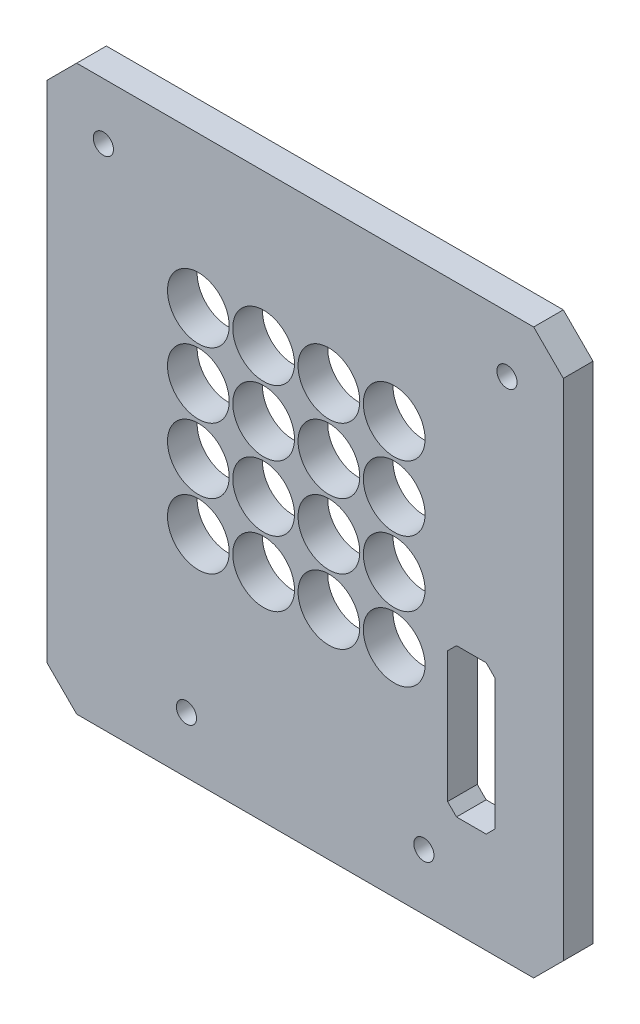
ISO-10303-21;
HEADER;
FILE_DESCRIPTION(('STEP AP214'),'2;1');
FILE_NAME('part.step','',(''),(''),'','','');
FILE_SCHEMA(('AUTOMOTIVE_DESIGN { 1 0 10303 214 1 1 1 1 }'));
ENDSEC;
DATA;
#1=APPLICATION_CONTEXT('core data for automotive mechanical design processes');
#2=APPLICATION_PROTOCOL_DEFINITION('international standard','automotive_design',2000,#1);
#3=PRODUCT_CONTEXT('',#1,'mechanical');
#4=PRODUCT('Part','Part','',(#3));
#5=PRODUCT_RELATED_PRODUCT_CATEGORY('part','',(#4));
#6=PRODUCT_DEFINITION_FORMATION('','',#4);
#7=PRODUCT_DEFINITION_CONTEXT('part definition',#1,'design');
#8=PRODUCT_DEFINITION('design','',#6,#7);
#9=PRODUCT_DEFINITION_SHAPE('','',#8);
#10=(LENGTH_UNIT() NAMED_UNIT(*) SI_UNIT(.MILLI.,.METRE.));
#11=(NAMED_UNIT(*) PLANE_ANGLE_UNIT() SI_UNIT($,.RADIAN.));
#12=(NAMED_UNIT(*) SI_UNIT($,.STERADIAN.) SOLID_ANGLE_UNIT());
#13=UNCERTAINTY_MEASURE_WITH_UNIT(LENGTH_MEASURE(1.E-05),#10,'distance_accuracy_value','');
#14=(GEOMETRIC_REPRESENTATION_CONTEXT(3) GLOBAL_UNCERTAINTY_ASSIGNED_CONTEXT((#13)) GLOBAL_UNIT_ASSIGNED_CONTEXT((#10,
#11,#12)) REPRESENTATION_CONTEXT('',''));
#15=CARTESIAN_POINT('',(0.,0.,0.));
#16=DIRECTION('',(0.,0.,1.));
#17=DIRECTION('',(1.,0.,0.));
#18=AXIS2_PLACEMENT_3D('',#15,#16,#17);
#19=CARTESIAN_POINT('',(0.,0.,5.));
#20=DIRECTION('',(0.,0.,1.));
#21=DIRECTION('',(1.,0.,0.));
#22=AXIS2_PLACEMENT_3D('',#19,#20,#21);
#23=PLANE('',#22);
#24=CARTESIAN_POINT('',(-18.5,-43.5,5.));
#25=DIRECTION('',(0.,0.,1.));
#26=DIRECTION('',(1.,0.,0.));
#27=AXIS2_PLACEMENT_3D('',#24,#25,#26);
#28=CIRCLE('',#27,1.7);
#29=CARTESIAN_POINT('',(-16.8,-43.5,5.));
#30=VERTEX_POINT('',#29);
#31=EDGE_CURVE('E227',#30,#30,#28,.T.);
#32=ORIENTED_EDGE('',*,*,#31,.F.);
#33=EDGE_LOOP('',(#32));
#34=FACE_BOUND('',#33,.T.);
#35=CARTESIAN_POINT('',(-32.5,32.5,5.));
#36=DIRECTION('',(0.,0.,1.));
#37=DIRECTION('',(1.,0.,0.));
#38=AXIS2_PLACEMENT_3D('',#35,#36,#37);
#39=CIRCLE('',#38,1.7);
#40=CARTESIAN_POINT('',(-30.8,32.5,5.));
#41=VERTEX_POINT('',#40);
#42=EDGE_CURVE('E239',#41,#41,#39,.T.);
#43=ORIENTED_EDGE('',*,*,#42,.F.);
#44=EDGE_LOOP('',(#43));
#45=FACE_BOUND('',#44,.T.);
#46=CARTESIAN_POINT('',(5.5,16.5,5.));
#47=DIRECTION('',(0.,0.,1.));
#48=DIRECTION('',(1.,0.,0.));
#49=AXIS2_PLACEMENT_3D('',#46,#47,#48);
#50=CIRCLE('',#49,5.2);
#51=CARTESIAN_POINT('',(10.7,16.5,5.));
#52=VERTEX_POINT('',#51);
#53=EDGE_CURVE('E251',#52,#52,#50,.T.);
#54=ORIENTED_EDGE('',*,*,#53,.F.);
#55=EDGE_LOOP('',(#54));
#56=FACE_BOUND('',#55,.T.);
#57=CARTESIAN_POINT('',(-16.5,16.5,5.));
#58=DIRECTION('',(0.,0.,1.));
#59=DIRECTION('',(1.,0.,0.));
#60=AXIS2_PLACEMENT_3D('',#57,#58,#59);
#61=CIRCLE('',#60,5.2);
#62=CARTESIAN_POINT('',(-11.3,16.5,5.));
#63=VERTEX_POINT('',#62);
#64=EDGE_CURVE('E263',#63,#63,#61,.T.);
#65=ORIENTED_EDGE('',*,*,#64,.F.);
#66=EDGE_LOOP('',(#65));
#67=FACE_BOUND('',#66,.T.);
#68=CARTESIAN_POINT('',(5.5,5.5,5.));
#69=DIRECTION('',(0.,0.,1.));
#70=DIRECTION('',(1.,0.,0.));
#71=AXIS2_PLACEMENT_3D('',#68,#69,#70);
#72=CIRCLE('',#71,5.2);
#73=CARTESIAN_POINT('',(10.7,5.5,5.));
#74=VERTEX_POINT('',#73);
#75=EDGE_CURVE('E275',#74,#74,#72,.T.);
#76=ORIENTED_EDGE('',*,*,#75,.F.);
#77=EDGE_LOOP('',(#76));
#78=FACE_BOUND('',#77,.T.);
#79=CARTESIAN_POINT('',(-16.5,5.5,5.));
#80=DIRECTION('',(0.,0.,1.));
#81=DIRECTION('',(1.,0.,0.));
#82=AXIS2_PLACEMENT_3D('',#79,#80,#81);
#83=CIRCLE('',#82,5.2);
#84=CARTESIAN_POINT('',(-11.3,5.5,5.));
#85=VERTEX_POINT('',#84);
#86=EDGE_CURVE('E287',#85,#85,#83,.T.);
#87=ORIENTED_EDGE('',*,*,#86,.F.);
#88=EDGE_LOOP('',(#87));
#89=FACE_BOUND('',#88,.T.);
#90=CARTESIAN_POINT('',(5.5,-5.5,5.));
#91=DIRECTION('',(0.,0.,1.));
#92=DIRECTION('',(1.,0.,0.));
#93=AXIS2_PLACEMENT_3D('',#90,#91,#92);
#94=CIRCLE('',#93,5.2);
#95=CARTESIAN_POINT('',(10.7,-5.5,5.));
#96=VERTEX_POINT('',#95);
#97=EDGE_CURVE('E299',#96,#96,#94,.T.);
#98=ORIENTED_EDGE('',*,*,#97,.F.);
#99=EDGE_LOOP('',(#98));
#100=FACE_BOUND('',#99,.T.);
#101=CARTESIAN_POINT('',(-16.5,-5.5,5.));
#102=DIRECTION('',(0.,0.,1.));
#103=DIRECTION('',(1.,0.,0.));
#104=AXIS2_PLACEMENT_3D('',#101,#102,#103);
#105=CIRCLE('',#104,5.2);
#106=CARTESIAN_POINT('',(-11.3,-5.5,5.));
#107=VERTEX_POINT('',#106);
#108=EDGE_CURVE('E311',#107,#107,#105,.T.);
#109=ORIENTED_EDGE('',*,*,#108,.F.);
#110=EDGE_LOOP('',(#109));
#111=FACE_BOUND('',#110,.T.);
#112=CARTESIAN_POINT('',(5.5,-16.5,5.));
#113=DIRECTION('',(0.,0.,1.));
#114=DIRECTION('',(1.,0.,0.));
#115=AXIS2_PLACEMENT_3D('',#112,#113,#114);
#116=CIRCLE('',#115,5.2);
#117=CARTESIAN_POINT('',(10.7,-16.5,5.));
#118=VERTEX_POINT('',#117);
#119=EDGE_CURVE('E323',#118,#118,#116,.T.);
#120=ORIENTED_EDGE('',*,*,#119,.F.);
#121=EDGE_LOOP('',(#120));
#122=FACE_BOUND('',#121,.T.);
#123=CARTESIAN_POINT('',(-16.5,-16.5,5.));
#124=DIRECTION('',(0.,0.,1.));
#125=DIRECTION('',(1.,0.,0.));
#126=AXIS2_PLACEMENT_3D('',#123,#124,#125);
#127=CIRCLE('',#126,5.2);
#128=CARTESIAN_POINT('',(-11.3,-16.5,5.));
#129=VERTEX_POINT('',#128);
#130=EDGE_CURVE('E335',#129,#129,#127,.T.);
#131=ORIENTED_EDGE('',*,*,#130,.F.);
#132=EDGE_LOOP('',(#131));
#133=FACE_BOUND('',#132,.T.);
#134=DIRECTION('',(0.707106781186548,-0.707106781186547,0.));
#135=VECTOR('',#134,1.);
#136=CARTESIAN_POINT('',(-42.,-48.,5.));
#137=LINE('',#136,#135);
#138=CARTESIAN_POINT('',(-42.,-48.,5.));
#139=VERTEX_POINT('',#138);
#140=CARTESIAN_POINT('',(-37.,-53.,5.));
#141=VERTEX_POINT('',#140);
#142=EDGE_CURVE('E341',#139,#141,#137,.T.);
#143=ORIENTED_EDGE('',*,*,#142,.T.);
#144=DIRECTION('',(1.,0.,0.));
#145=VECTOR('',#144,1.);
#146=CARTESIAN_POINT('',(-37.,-53.,5.));
#147=LINE('',#146,#145);
#148=CARTESIAN_POINT('',(40.,-53.,5.));
#149=VERTEX_POINT('',#148);
#150=EDGE_CURVE('E344',#141,#149,#147,.T.);
#151=ORIENTED_EDGE('',*,*,#150,.T.);
#152=DIRECTION('',(0.707106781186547,0.707106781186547,0.));
#153=VECTOR('',#152,1.);
#154=CARTESIAN_POINT('',(40.,-53.,5.));
#155=LINE('',#154,#153);
#156=CARTESIAN_POINT('',(45.,-48.,5.));
#157=VERTEX_POINT('',#156);
#158=EDGE_CURVE('E347',#149,#157,#155,.T.);
#159=ORIENTED_EDGE('',*,*,#158,.T.);
#160=DIRECTION('',(0.,1.,0.));
#161=VECTOR('',#160,1.);
#162=CARTESIAN_POINT('',(45.,-48.,5.));
#163=LINE('',#162,#161);
#164=CARTESIAN_POINT('',(45.,37.,5.));
#165=VERTEX_POINT('',#164);
#166=EDGE_CURVE('E349',#157,#165,#163,.T.);
#167=ORIENTED_EDGE('',*,*,#166,.T.);
#168=DIRECTION('',(-0.707106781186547,0.707106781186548,0.));
#169=VECTOR('',#168,1.);
#170=CARTESIAN_POINT('',(45.,37.,5.));
#171=LINE('',#170,#169);
#172=CARTESIAN_POINT('',(40.,42.,5.));
#173=VERTEX_POINT('',#172);
#174=EDGE_CURVE('E351',#165,#173,#171,.T.);
#175=ORIENTED_EDGE('',*,*,#174,.T.);
#176=DIRECTION('',(-1.,0.,0.));
#177=VECTOR('',#176,1.);
#178=CARTESIAN_POINT('',(40.,42.,5.));
#179=LINE('',#178,#177);
#180=CARTESIAN_POINT('',(-37.,42.,5.));
#181=VERTEX_POINT('',#180);
#182=EDGE_CURVE('E353',#173,#181,#179,.T.);
#183=ORIENTED_EDGE('',*,*,#182,.T.);
#184=DIRECTION('',(-0.707106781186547,-0.707106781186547,0.));
#185=VECTOR('',#184,1.);
#186=CARTESIAN_POINT('',(-37.,42.,5.));
#187=LINE('',#186,#185);
#188=CARTESIAN_POINT('',(-42.,37.,5.));
#189=VERTEX_POINT('',#188);
#190=EDGE_CURVE('E355',#181,#189,#187,.T.);
#191=ORIENTED_EDGE('',*,*,#190,.T.);
#192=DIRECTION('',(0.,-1.,0.));
#193=VECTOR('',#192,1.);
#194=CARTESIAN_POINT('',(-42.,37.,5.));
#195=LINE('',#194,#193);
#196=EDGE_CURVE('E357',#189,#139,#195,.T.);
#197=ORIENTED_EDGE('',*,*,#196,.T.);
#198=EDGE_LOOP('',(#143,#151,#159,#167,#175,#183,#191,#197));
#199=FACE_BOUND('',#198,.T.);
#200=CARTESIAN_POINT('',(-5.5,-16.5,5.));
#201=DIRECTION('',(0.,0.,1.));
#202=DIRECTION('',(1.,0.,0.));
#203=AXIS2_PLACEMENT_3D('',#200,#201,#202);
#204=CIRCLE('',#203,5.2);
#205=CARTESIAN_POINT('',(-0.3,-16.5,5.));
#206=VERTEX_POINT('',#205);
#207=EDGE_CURVE('E329',#206,#206,#204,.T.);
#208=ORIENTED_EDGE('',*,*,#207,.F.);
#209=EDGE_LOOP('',(#208));
#210=FACE_BOUND('',#209,.T.);
#211=CARTESIAN_POINT('',(16.5,-16.5,5.));
#212=DIRECTION('',(0.,0.,1.));
#213=DIRECTION('',(1.,0.,0.));
#214=AXIS2_PLACEMENT_3D('',#211,#212,#213);
#215=CIRCLE('',#214,5.2);
#216=CARTESIAN_POINT('',(21.7,-16.5,5.));
#217=VERTEX_POINT('',#216);
#218=EDGE_CURVE('E317',#217,#217,#215,.T.);
#219=ORIENTED_EDGE('',*,*,#218,.F.);
#220=EDGE_LOOP('',(#219));
#221=FACE_BOUND('',#220,.T.);
#222=CARTESIAN_POINT('',(-5.5,-5.5,5.));
#223=DIRECTION('',(0.,0.,1.));
#224=DIRECTION('',(1.,0.,0.));
#225=AXIS2_PLACEMENT_3D('',#222,#223,#224);
#226=CIRCLE('',#225,5.2);
#227=CARTESIAN_POINT('',(-0.3,-5.5,5.));
#228=VERTEX_POINT('',#227);
#229=EDGE_CURVE('E305',#228,#228,#226,.T.);
#230=ORIENTED_EDGE('',*,*,#229,.F.);
#231=EDGE_LOOP('',(#230));
#232=FACE_BOUND('',#231,.T.);
#233=CARTESIAN_POINT('',(16.5,-5.5,5.));
#234=DIRECTION('',(0.,0.,1.));
#235=DIRECTION('',(1.,0.,0.));
#236=AXIS2_PLACEMENT_3D('',#233,#234,#235);
#237=CIRCLE('',#236,5.2);
#238=CARTESIAN_POINT('',(21.7,-5.5,5.));
#239=VERTEX_POINT('',#238);
#240=EDGE_CURVE('E293',#239,#239,#237,.T.);
#241=ORIENTED_EDGE('',*,*,#240,.F.);
#242=EDGE_LOOP('',(#241));
#243=FACE_BOUND('',#242,.T.);
#244=CARTESIAN_POINT('',(-5.5,5.5,5.));
#245=DIRECTION('',(0.,0.,1.));
#246=DIRECTION('',(1.,0.,0.));
#247=AXIS2_PLACEMENT_3D('',#244,#245,#246);
#248=CIRCLE('',#247,5.2);
#249=CARTESIAN_POINT('',(-0.3,5.5,5.));
#250=VERTEX_POINT('',#249);
#251=EDGE_CURVE('E281',#250,#250,#248,.T.);
#252=ORIENTED_EDGE('',*,*,#251,.F.);
#253=EDGE_LOOP('',(#252));
#254=FACE_BOUND('',#253,.T.);
#255=CARTESIAN_POINT('',(16.5,5.5,5.));
#256=DIRECTION('',(0.,0.,1.));
#257=DIRECTION('',(1.,0.,0.));
#258=AXIS2_PLACEMENT_3D('',#255,#256,#257);
#259=CIRCLE('',#258,5.2);
#260=CARTESIAN_POINT('',(21.7,5.5,5.));
#261=VERTEX_POINT('',#260);
#262=EDGE_CURVE('E269',#261,#261,#259,.T.);
#263=ORIENTED_EDGE('',*,*,#262,.F.);
#264=EDGE_LOOP('',(#263));
#265=FACE_BOUND('',#264,.T.);
#266=CARTESIAN_POINT('',(-5.5,16.5,5.));
#267=DIRECTION('',(0.,0.,1.));
#268=DIRECTION('',(1.,0.,0.));
#269=AXIS2_PLACEMENT_3D('',#266,#267,#268);
#270=CIRCLE('',#269,5.2);
#271=CARTESIAN_POINT('',(-0.3,16.5,5.));
#272=VERTEX_POINT('',#271);
#273=EDGE_CURVE('E257',#272,#272,#270,.T.);
#274=ORIENTED_EDGE('',*,*,#273,.F.);
#275=EDGE_LOOP('',(#274));
#276=FACE_BOUND('',#275,.T.);
#277=CARTESIAN_POINT('',(16.5,16.5,5.));
#278=DIRECTION('',(0.,0.,1.));
#279=DIRECTION('',(1.,0.,0.));
#280=AXIS2_PLACEMENT_3D('',#277,#278,#279);
#281=CIRCLE('',#280,5.2);
#282=CARTESIAN_POINT('',(21.7,16.5,5.));
#283=VERTEX_POINT('',#282);
#284=EDGE_CURVE('E245',#283,#283,#281,.T.);
#285=ORIENTED_EDGE('',*,*,#284,.F.);
#286=EDGE_LOOP('',(#285));
#287=FACE_BOUND('',#286,.T.);
#288=CARTESIAN_POINT('',(35.5,32.5,5.));
#289=DIRECTION('',(0.,0.,1.));
#290=DIRECTION('',(1.,0.,0.));
#291=AXIS2_PLACEMENT_3D('',#288,#289,#290);
#292=CIRCLE('',#291,1.7);
#293=CARTESIAN_POINT('',(37.2,32.5,5.));
#294=VERTEX_POINT('',#293);
#295=EDGE_CURVE('E233',#294,#294,#292,.T.);
#296=ORIENTED_EDGE('',*,*,#295,.F.);
#297=EDGE_LOOP('',(#296));
#298=FACE_BOUND('',#297,.T.);
#299=CARTESIAN_POINT('',(21.5,-43.5,5.));
#300=DIRECTION('',(0.,0.,1.));
#301=DIRECTION('',(1.,0.,0.));
#302=AXIS2_PLACEMENT_3D('',#299,#300,#301);
#303=CIRCLE('',#302,1.7);
#304=CARTESIAN_POINT('',(23.2,-43.5,5.));
#305=VERTEX_POINT('',#304);
#306=EDGE_CURVE('E221',#305,#305,#303,.T.);
#307=ORIENTED_EDGE('',*,*,#306,.F.);
#308=EDGE_LOOP('',(#307));
#309=FACE_BOUND('',#308,.T.);
#310=DIRECTION('',(1.,0.,0.));
#311=VECTOR('',#310,1.);
#312=CARTESIAN_POINT('',(27.,-36.,5.));
#313=LINE('',#312,#311);
#314=CARTESIAN_POINT('',(27.,-36.,5.));
#315=VERTEX_POINT('',#314);
#316=CARTESIAN_POINT('',(32.,-36.,5.));
#317=VERTEX_POINT('',#316);
#318=EDGE_CURVE('E164',#315,#317,#313,.T.);
#319=ORIENTED_EDGE('',*,*,#318,.F.);
#320=DIRECTION('',(0.707106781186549,-0.707106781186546,0.));
#321=VECTOR('',#320,1.);
#322=CARTESIAN_POINT('',(25.5,-34.5,5.));
#323=LINE('',#322,#321);
#324=CARTESIAN_POINT('',(25.5,-34.5,5.));
#325=VERTEX_POINT('',#324);
#326=EDGE_CURVE('E156',#325,#315,#323,.T.);
#327=ORIENTED_EDGE('',*,*,#326,.F.);
#328=DIRECTION('',(0.,-1.,0.));
#329=VECTOR('',#328,1.);
#330=CARTESIAN_POINT('',(25.5,-12.5,5.));
#331=LINE('',#330,#329);
#332=CARTESIAN_POINT('',(25.5,-12.5,5.));
#333=VERTEX_POINT('',#332);
#334=EDGE_CURVE('E189',#333,#325,#331,.T.);
#335=ORIENTED_EDGE('',*,*,#334,.F.);
#336=DIRECTION('',(-0.707106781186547,-0.707106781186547,0.));
#337=VECTOR('',#336,1.);
#338=CARTESIAN_POINT('',(27.,-11.,5.));
#339=LINE('',#338,#337);
#340=CARTESIAN_POINT('',(27.,-11.,5.));
#341=VERTEX_POINT('',#340);
#342=EDGE_CURVE('E187',#341,#333,#339,.T.);
#343=ORIENTED_EDGE('',*,*,#342,.F.);
#344=DIRECTION('',(-1.,0.,0.));
#345=VECTOR('',#344,1.);
#346=CARTESIAN_POINT('',(32.,-11.,5.));
#347=LINE('',#346,#345);
#348=CARTESIAN_POINT('',(32.,-11.,5.));
#349=VERTEX_POINT('',#348);
#350=EDGE_CURVE('E185',#349,#341,#347,.T.);
#351=ORIENTED_EDGE('',*,*,#350,.F.);
#352=DIRECTION('',(-0.707106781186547,0.707106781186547,0.));
#353=VECTOR('',#352,1.);
#354=CARTESIAN_POINT('',(33.5,-12.5,5.));
#355=LINE('',#354,#353);
#356=CARTESIAN_POINT('',(33.5,-12.5,5.));
#357=VERTEX_POINT('',#356);
#358=EDGE_CURVE('E183',#357,#349,#355,.T.);
#359=ORIENTED_EDGE('',*,*,#358,.F.);
#360=DIRECTION('',(0.,1.,0.));
#361=VECTOR('',#360,1.);
#362=CARTESIAN_POINT('',(33.5,-34.5,5.));
#363=LINE('',#362,#361);
#364=CARTESIAN_POINT('',(33.5,-34.5,5.));
#365=VERTEX_POINT('',#364);
#366=EDGE_CURVE('E179',#365,#357,#363,.T.);
#367=ORIENTED_EDGE('',*,*,#366,.F.);
#368=DIRECTION('',(0.707106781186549,0.707106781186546,0.));
#369=VECTOR('',#368,1.);
#370=CARTESIAN_POINT('',(32.,-36.,5.));
#371=LINE('',#370,#369);
#372=EDGE_CURVE('E177',#317,#365,#371,.T.);
#373=ORIENTED_EDGE('',*,*,#372,.F.);
#374=EDGE_LOOP('',(#319,#327,#335,#343,#351,#359,#367,#373));
#375=FACE_BOUND('',#374,.T.);
#376=ADVANCED_FACE('F43',(#34,#45,#56,#67,#78,#89,#100,#111,#122,#133,#199,#210,#221,#232,#243,
#254,#265,#276,#287,#298,#309,#375),#23,.T.);
#377=CARTESIAN_POINT('',(0.,0.,0.));
#378=DIRECTION('',(0.,0.,1.));
#379=DIRECTION('',(1.,0.,0.));
#380=AXIS2_PLACEMENT_3D('',#377,#378,#379);
#381=PLANE('',#380);
#382=CARTESIAN_POINT('',(21.5,-43.5,0.));
#383=DIRECTION('',(0.,0.,1.));
#384=DIRECTION('',(1.,0.,0.));
#385=AXIS2_PLACEMENT_3D('',#382,#383,#384);
#386=CIRCLE('',#385,1.7);
#387=CARTESIAN_POINT('',(23.2,-43.5,0.));
#388=VERTEX_POINT('',#387);
#389=EDGE_CURVE('E172',#388,#388,#386,.T.);
#390=ORIENTED_EDGE('',*,*,#389,.T.);
#391=EDGE_LOOP('',(#390));
#392=FACE_BOUND('',#391,.T.);
#393=CARTESIAN_POINT('',(-18.5,-43.5,0.));
#394=DIRECTION('',(0.,0.,1.));
#395=DIRECTION('',(1.,0.,0.));
#396=AXIS2_PLACEMENT_3D('',#393,#394,#395);
#397=CIRCLE('',#396,1.7);
#398=CARTESIAN_POINT('',(-16.8,-43.5,0.));
#399=VERTEX_POINT('',#398);
#400=EDGE_CURVE('E224',#399,#399,#397,.T.);
#401=ORIENTED_EDGE('',*,*,#400,.T.);
#402=EDGE_LOOP('',(#401));
#403=FACE_BOUND('',#402,.T.);
#404=CARTESIAN_POINT('',(35.5,32.5,0.));
#405=DIRECTION('',(0.,0.,1.));
#406=DIRECTION('',(1.,0.,0.));
#407=AXIS2_PLACEMENT_3D('',#404,#405,#406);
#408=CIRCLE('',#407,1.7);
#409=CARTESIAN_POINT('',(37.2,32.5,0.));
#410=VERTEX_POINT('',#409);
#411=EDGE_CURVE('E230',#410,#410,#408,.T.);
#412=ORIENTED_EDGE('',*,*,#411,.T.);
#413=EDGE_LOOP('',(#412));
#414=FACE_BOUND('',#413,.T.);
#415=CARTESIAN_POINT('',(-32.5,32.5,0.));
#416=DIRECTION('',(0.,0.,1.));
#417=DIRECTION('',(1.,0.,0.));
#418=AXIS2_PLACEMENT_3D('',#415,#416,#417);
#419=CIRCLE('',#418,1.7);
#420=CARTESIAN_POINT('',(-30.8,32.5,0.));
#421=VERTEX_POINT('',#420);
#422=EDGE_CURVE('E236',#421,#421,#419,.T.);
#423=ORIENTED_EDGE('',*,*,#422,.T.);
#424=EDGE_LOOP('',(#423));
#425=FACE_BOUND('',#424,.T.);
#426=CARTESIAN_POINT('',(16.5,16.5,0.));
#427=DIRECTION('',(0.,0.,1.));
#428=DIRECTION('',(1.,0.,0.));
#429=AXIS2_PLACEMENT_3D('',#426,#427,#428);
#430=CIRCLE('',#429,5.2);
#431=CARTESIAN_POINT('',(21.7,16.5,0.));
#432=VERTEX_POINT('',#431);
#433=EDGE_CURVE('E242',#432,#432,#430,.T.);
#434=ORIENTED_EDGE('',*,*,#433,.T.);
#435=EDGE_LOOP('',(#434));
#436=FACE_BOUND('',#435,.T.);
#437=CARTESIAN_POINT('',(5.5,16.5,0.));
#438=DIRECTION('',(0.,0.,1.));
#439=DIRECTION('',(1.,0.,0.));
#440=AXIS2_PLACEMENT_3D('',#437,#438,#439);
#441=CIRCLE('',#440,5.2);
#442=CARTESIAN_POINT('',(10.7,16.5,0.));
#443=VERTEX_POINT('',#442);
#444=EDGE_CURVE('E248',#443,#443,#441,.T.);
#445=ORIENTED_EDGE('',*,*,#444,.T.);
#446=EDGE_LOOP('',(#445));
#447=FACE_BOUND('',#446,.T.);
#448=CARTESIAN_POINT('',(-5.5,16.5,0.));
#449=DIRECTION('',(0.,0.,1.));
#450=DIRECTION('',(1.,0.,0.));
#451=AXIS2_PLACEMENT_3D('',#448,#449,#450);
#452=CIRCLE('',#451,5.2);
#453=CARTESIAN_POINT('',(-0.3,16.5,0.));
#454=VERTEX_POINT('',#453);
#455=EDGE_CURVE('E254',#454,#454,#452,.T.);
#456=ORIENTED_EDGE('',*,*,#455,.T.);
#457=EDGE_LOOP('',(#456));
#458=FACE_BOUND('',#457,.T.);
#459=CARTESIAN_POINT('',(-16.5,16.5,0.));
#460=DIRECTION('',(0.,0.,1.));
#461=DIRECTION('',(1.,0.,0.));
#462=AXIS2_PLACEMENT_3D('',#459,#460,#461);
#463=CIRCLE('',#462,5.2);
#464=CARTESIAN_POINT('',(-11.3,16.5,0.));
#465=VERTEX_POINT('',#464);
#466=EDGE_CURVE('E260',#465,#465,#463,.T.);
#467=ORIENTED_EDGE('',*,*,#466,.T.);
#468=EDGE_LOOP('',(#467));
#469=FACE_BOUND('',#468,.T.);
#470=CARTESIAN_POINT('',(16.5,5.5,0.));
#471=DIRECTION('',(0.,0.,1.));
#472=DIRECTION('',(1.,0.,0.));
#473=AXIS2_PLACEMENT_3D('',#470,#471,#472);
#474=CIRCLE('',#473,5.2);
#475=CARTESIAN_POINT('',(21.7,5.5,0.));
#476=VERTEX_POINT('',#475);
#477=EDGE_CURVE('E266',#476,#476,#474,.T.);
#478=ORIENTED_EDGE('',*,*,#477,.T.);
#479=EDGE_LOOP('',(#478));
#480=FACE_BOUND('',#479,.T.);
#481=CARTESIAN_POINT('',(5.5,5.5,0.));
#482=DIRECTION('',(0.,0.,1.));
#483=DIRECTION('',(1.,0.,0.));
#484=AXIS2_PLACEMENT_3D('',#481,#482,#483);
#485=CIRCLE('',#484,5.2);
#486=CARTESIAN_POINT('',(10.7,5.5,0.));
#487=VERTEX_POINT('',#486);
#488=EDGE_CURVE('E272',#487,#487,#485,.T.);
#489=ORIENTED_EDGE('',*,*,#488,.T.);
#490=EDGE_LOOP('',(#489));
#491=FACE_BOUND('',#490,.T.);
#492=CARTESIAN_POINT('',(-5.5,5.5,0.));
#493=DIRECTION('',(0.,0.,1.));
#494=DIRECTION('',(1.,0.,0.));
#495=AXIS2_PLACEMENT_3D('',#492,#493,#494);
#496=CIRCLE('',#495,5.2);
#497=CARTESIAN_POINT('',(-0.3,5.5,0.));
#498=VERTEX_POINT('',#497);
#499=EDGE_CURVE('E278',#498,#498,#496,.T.);
#500=ORIENTED_EDGE('',*,*,#499,.T.);
#501=EDGE_LOOP('',(#500));
#502=FACE_BOUND('',#501,.T.);
#503=CARTESIAN_POINT('',(-16.5,5.5,0.));
#504=DIRECTION('',(0.,0.,1.));
#505=DIRECTION('',(1.,0.,0.));
#506=AXIS2_PLACEMENT_3D('',#503,#504,#505);
#507=CIRCLE('',#506,5.2);
#508=CARTESIAN_POINT('',(-11.3,5.5,0.));
#509=VERTEX_POINT('',#508);
#510=EDGE_CURVE('E284',#509,#509,#507,.T.);
#511=ORIENTED_EDGE('',*,*,#510,.T.);
#512=EDGE_LOOP('',(#511));
#513=FACE_BOUND('',#512,.T.);
#514=CARTESIAN_POINT('',(16.5,-5.5,0.));
#515=DIRECTION('',(0.,0.,1.));
#516=DIRECTION('',(1.,0.,0.));
#517=AXIS2_PLACEMENT_3D('',#514,#515,#516);
#518=CIRCLE('',#517,5.2);
#519=CARTESIAN_POINT('',(21.7,-5.5,0.));
#520=VERTEX_POINT('',#519);
#521=EDGE_CURVE('E290',#520,#520,#518,.T.);
#522=ORIENTED_EDGE('',*,*,#521,.T.);
#523=EDGE_LOOP('',(#522));
#524=FACE_BOUND('',#523,.T.);
#525=CARTESIAN_POINT('',(5.5,-5.5,0.));
#526=DIRECTION('',(0.,0.,1.));
#527=DIRECTION('',(1.,0.,0.));
#528=AXIS2_PLACEMENT_3D('',#525,#526,#527);
#529=CIRCLE('',#528,5.2);
#530=CARTESIAN_POINT('',(10.7,-5.5,0.));
#531=VERTEX_POINT('',#530);
#532=EDGE_CURVE('E296',#531,#531,#529,.T.);
#533=ORIENTED_EDGE('',*,*,#532,.T.);
#534=EDGE_LOOP('',(#533));
#535=FACE_BOUND('',#534,.T.);
#536=CARTESIAN_POINT('',(-5.5,-5.5,0.));
#537=DIRECTION('',(0.,0.,1.));
#538=DIRECTION('',(1.,0.,0.));
#539=AXIS2_PLACEMENT_3D('',#536,#537,#538);
#540=CIRCLE('',#539,5.2);
#541=CARTESIAN_POINT('',(-0.3,-5.5,0.));
#542=VERTEX_POINT('',#541);
#543=EDGE_CURVE('E302',#542,#542,#540,.T.);
#544=ORIENTED_EDGE('',*,*,#543,.T.);
#545=EDGE_LOOP('',(#544));
#546=FACE_BOUND('',#545,.T.);
#547=CARTESIAN_POINT('',(-16.5,-5.5,0.));
#548=DIRECTION('',(0.,0.,1.));
#549=DIRECTION('',(1.,0.,0.));
#550=AXIS2_PLACEMENT_3D('',#547,#548,#549);
#551=CIRCLE('',#550,5.2);
#552=CARTESIAN_POINT('',(-11.3,-5.5,0.));
#553=VERTEX_POINT('',#552);
#554=EDGE_CURVE('E308',#553,#553,#551,.T.);
#555=ORIENTED_EDGE('',*,*,#554,.T.);
#556=EDGE_LOOP('',(#555));
#557=FACE_BOUND('',#556,.T.);
#558=CARTESIAN_POINT('',(16.5,-16.5,0.));
#559=DIRECTION('',(0.,0.,1.));
#560=DIRECTION('',(1.,0.,0.));
#561=AXIS2_PLACEMENT_3D('',#558,#559,#560);
#562=CIRCLE('',#561,5.2);
#563=CARTESIAN_POINT('',(21.7,-16.5,0.));
#564=VERTEX_POINT('',#563);
#565=EDGE_CURVE('E314',#564,#564,#562,.T.);
#566=ORIENTED_EDGE('',*,*,#565,.T.);
#567=EDGE_LOOP('',(#566));
#568=FACE_BOUND('',#567,.T.);
#569=CARTESIAN_POINT('',(5.5,-16.5,0.));
#570=DIRECTION('',(0.,0.,1.));
#571=DIRECTION('',(1.,0.,0.));
#572=AXIS2_PLACEMENT_3D('',#569,#570,#571);
#573=CIRCLE('',#572,5.2);
#574=CARTESIAN_POINT('',(10.7,-16.5,0.));
#575=VERTEX_POINT('',#574);
#576=EDGE_CURVE('E320',#575,#575,#573,.T.);
#577=ORIENTED_EDGE('',*,*,#576,.T.);
#578=EDGE_LOOP('',(#577));
#579=FACE_BOUND('',#578,.T.);
#580=CARTESIAN_POINT('',(-5.5,-16.5,0.));
#581=DIRECTION('',(0.,0.,1.));
#582=DIRECTION('',(1.,0.,0.));
#583=AXIS2_PLACEMENT_3D('',#580,#581,#582);
#584=CIRCLE('',#583,5.2);
#585=CARTESIAN_POINT('',(-0.3,-16.5,0.));
#586=VERTEX_POINT('',#585);
#587=EDGE_CURVE('E326',#586,#586,#584,.T.);
#588=ORIENTED_EDGE('',*,*,#587,.T.);
#589=EDGE_LOOP('',(#588));
#590=FACE_BOUND('',#589,.T.);
#591=CARTESIAN_POINT('',(-16.5,-16.5,0.));
#592=DIRECTION('',(0.,0.,1.));
#593=DIRECTION('',(1.,0.,0.));
#594=AXIS2_PLACEMENT_3D('',#591,#592,#593);
#595=CIRCLE('',#594,5.2);
#596=CARTESIAN_POINT('',(-11.3,-16.5,0.));
#597=VERTEX_POINT('',#596);
#598=EDGE_CURVE('E332',#597,#597,#595,.T.);
#599=ORIENTED_EDGE('',*,*,#598,.T.);
#600=EDGE_LOOP('',(#599));
#601=FACE_BOUND('',#600,.T.);
#602=DIRECTION('',(0.707106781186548,-0.707106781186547,0.));
#603=VECTOR('',#602,1.);
#604=CARTESIAN_POINT('',(-42.,-48.,0.));
#605=LINE('',#604,#603);
#606=CARTESIAN_POINT('',(-42.,-48.,0.));
#607=VERTEX_POINT('',#606);
#608=CARTESIAN_POINT('',(-37.,-53.,0.));
#609=VERTEX_POINT('',#608);
#610=EDGE_CURVE('E338',#607,#609,#605,.T.);
#611=ORIENTED_EDGE('',*,*,#610,.F.);
#612=DIRECTION('',(0.,-1.,0.));
#613=VECTOR('',#612,1.);
#614=CARTESIAN_POINT('',(-42.,37.,0.));
#615=LINE('',#614,#613);
#616=CARTESIAN_POINT('',(-42.,37.,0.));
#617=VERTEX_POINT('',#616);
#618=EDGE_CURVE('E345',#617,#607,#615,.T.);
#619=ORIENTED_EDGE('',*,*,#618,.F.);
#620=DIRECTION('',(-0.707106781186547,-0.707106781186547,0.));
#621=VECTOR('',#620,1.);
#622=CARTESIAN_POINT('',(-37.,42.,0.));
#623=LINE('',#622,#621);
#624=CARTESIAN_POINT('',(-37.,42.,0.));
#625=VERTEX_POINT('',#624);
#626=EDGE_CURVE('E372',#625,#617,#623,.T.);
#627=ORIENTED_EDGE('',*,*,#626,.F.);
#628=DIRECTION('',(-1.,0.,0.));
#629=VECTOR('',#628,1.);
#630=CARTESIAN_POINT('',(40.,42.,0.));
#631=LINE('',#630,#629);
#632=CARTESIAN_POINT('',(40.,42.,0.));
#633=VERTEX_POINT('',#632);
#634=EDGE_CURVE('E370',#633,#625,#631,.T.);
#635=ORIENTED_EDGE('',*,*,#634,.F.);
#636=DIRECTION('',(-0.707106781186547,0.707106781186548,0.));
#637=VECTOR('',#636,1.);
#638=CARTESIAN_POINT('',(45.,37.,0.));
#639=LINE('',#638,#637);
#640=CARTESIAN_POINT('',(45.,37.,0.));
#641=VERTEX_POINT('',#640);
#642=EDGE_CURVE('E368',#641,#633,#639,.T.);
#643=ORIENTED_EDGE('',*,*,#642,.F.);
#644=DIRECTION('',(0.,1.,0.));
#645=VECTOR('',#644,1.);
#646=CARTESIAN_POINT('',(45.,-48.,0.));
#647=LINE('',#646,#645);
#648=CARTESIAN_POINT('',(45.,-48.,0.));
#649=VERTEX_POINT('',#648);
#650=EDGE_CURVE('E366',#649,#641,#647,.T.);
#651=ORIENTED_EDGE('',*,*,#650,.F.);
#652=DIRECTION('',(0.707106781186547,0.707106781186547,0.));
#653=VECTOR('',#652,1.);
#654=CARTESIAN_POINT('',(40.,-53.,0.));
#655=LINE('',#654,#653);
#656=CARTESIAN_POINT('',(40.,-53.,0.));
#657=VERTEX_POINT('',#656);
#658=EDGE_CURVE('E364',#657,#649,#655,.T.);
#659=ORIENTED_EDGE('',*,*,#658,.F.);
#660=DIRECTION('',(1.,0.,0.));
#661=VECTOR('',#660,1.);
#662=CARTESIAN_POINT('',(-37.,-53.,0.));
#663=LINE('',#662,#661);
#664=EDGE_CURVE('E362',#609,#657,#663,.T.);
#665=ORIENTED_EDGE('',*,*,#664,.F.);
#666=EDGE_LOOP('',(#611,#619,#627,#635,#643,#651,#659,#665));
#667=FACE_BOUND('',#666,.T.);
#668=DIRECTION('',(0.707106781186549,-0.707106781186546,0.));
#669=VECTOR('',#668,1.);
#670=CARTESIAN_POINT('',(25.5,-34.5,0.));
#671=LINE('',#670,#669);
#672=CARTESIAN_POINT('',(25.5,-34.5,0.));
#673=VERTEX_POINT('',#672);
#674=CARTESIAN_POINT('',(27.,-36.,0.));
#675=VERTEX_POINT('',#674);
#676=EDGE_CURVE('E66',#673,#675,#671,.T.);
#677=ORIENTED_EDGE('',*,*,#676,.T.);
#678=DIRECTION('',(1.,0.,0.));
#679=VECTOR('',#678,1.);
#680=CARTESIAN_POINT('',(27.,-36.,0.));
#681=LINE('',#680,#679);
#682=CARTESIAN_POINT('',(32.,-36.,0.));
#683=VERTEX_POINT('',#682);
#684=EDGE_CURVE('E171',#675,#683,#681,.T.);
#685=ORIENTED_EDGE('',*,*,#684,.T.);
#686=DIRECTION('',(0.707106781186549,0.707106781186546,0.));
#687=VECTOR('',#686,1.);
#688=CARTESIAN_POINT('',(32.,-36.,0.));
#689=LINE('',#688,#687);
#690=CARTESIAN_POINT('',(33.5,-34.5,0.));
#691=VERTEX_POINT('',#690);
#692=EDGE_CURVE('E193',#683,#691,#689,.T.);
#693=ORIENTED_EDGE('',*,*,#692,.T.);
#694=DIRECTION('',(0.,1.,0.));
#695=VECTOR('',#694,1.);
#696=CARTESIAN_POINT('',(33.5,-34.5,0.));
#697=LINE('',#696,#695);
#698=CARTESIAN_POINT('',(33.5,-12.5,0.));
#699=VERTEX_POINT('',#698);
#700=EDGE_CURVE('E196',#691,#699,#697,.T.);
#701=ORIENTED_EDGE('',*,*,#700,.T.);
#702=DIRECTION('',(-0.707106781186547,0.707106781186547,0.));
#703=VECTOR('',#702,1.);
#704=CARTESIAN_POINT('',(33.5,-12.5,0.));
#705=LINE('',#704,#703);
#706=CARTESIAN_POINT('',(32.,-11.,0.));
#707=VERTEX_POINT('',#706);
#708=EDGE_CURVE('E199',#699,#707,#705,.T.);
#709=ORIENTED_EDGE('',*,*,#708,.T.);
#710=DIRECTION('',(-1.,0.,0.));
#711=VECTOR('',#710,1.);
#712=CARTESIAN_POINT('',(32.,-11.,0.));
#713=LINE('',#712,#711);
#714=CARTESIAN_POINT('',(27.,-11.,0.));
#715=VERTEX_POINT('',#714);
#716=EDGE_CURVE('E202',#707,#715,#713,.T.);
#717=ORIENTED_EDGE('',*,*,#716,.T.);
#718=DIRECTION('',(-0.707106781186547,-0.707106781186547,0.));
#719=VECTOR('',#718,1.);
#720=CARTESIAN_POINT('',(27.,-11.,0.));
#721=LINE('',#720,#719);
#722=CARTESIAN_POINT('',(25.5,-12.5,0.));
#723=VERTEX_POINT('',#722);
#724=EDGE_CURVE('E205',#715,#723,#721,.T.);
#725=ORIENTED_EDGE('',*,*,#724,.T.);
#726=DIRECTION('',(0.,-1.,0.));
#727=VECTOR('',#726,1.);
#728=CARTESIAN_POINT('',(25.5,-12.5,0.));
#729=LINE('',#728,#727);
#730=EDGE_CURVE('E165',#723,#673,#729,.T.);
#731=ORIENTED_EDGE('',*,*,#730,.T.);
#732=EDGE_LOOP('',(#677,#685,#693,#701,#709,#717,#725,#731));
#733=FACE_BOUND('',#732,.T.);
#734=ADVANCED_FACE('F402',(#392,#403,#414,#425,#436,#447,#458,#469,#480,#491,#502,#513,#524,
#535,#546,#557,#568,#579,#590,#601,#667,#733),#381,.F.);
#735=CARTESIAN_POINT('',(-42.,-48.,5.));
#736=DIRECTION('',(0.707106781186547,0.707106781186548,0.));
#737=DIRECTION('',(-0.707106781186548,0.707106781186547,0.));
#738=AXIS2_PLACEMENT_3D('',#735,#736,#737);
#739=PLANE('',#738);
#740=ORIENTED_EDGE('',*,*,#610,.T.);
#741=DIRECTION('',(0.,0.,-1.));
#742=VECTOR('',#741,1.);
#743=CARTESIAN_POINT('',(-37.,-53.,5.));
#744=LINE('',#743,#742);
#745=EDGE_CURVE('E11',#141,#609,#744,.T.);
#746=ORIENTED_EDGE('',*,*,#745,.F.);
#747=ORIENTED_EDGE('',*,*,#142,.F.);
#748=DIRECTION('',(0.,0.,-1.));
#749=VECTOR('',#748,1.);
#750=CARTESIAN_POINT('',(-42.,-48.,5.));
#751=LINE('',#750,#749);
#752=EDGE_CURVE('E359',#139,#607,#751,.T.);
#753=ORIENTED_EDGE('',*,*,#752,.T.);
#754=EDGE_LOOP('',(#740,#746,#747,#753));
#755=FACE_BOUND('',#754,.T.);
#756=ADVANCED_FACE('F45',(#755),#739,.F.);
#757=CARTESIAN_POINT('',(-37.,-53.,5.));
#758=DIRECTION('',(0.,1.,0.));
#759=DIRECTION('',(0.,0.,1.));
#760=AXIS2_PLACEMENT_3D('',#757,#758,#759);
#761=PLANE('',#760);
#762=ORIENTED_EDGE('',*,*,#664,.T.);
#763=DIRECTION('',(0.,0.,-1.));
#764=VECTOR('',#763,1.);
#765=CARTESIAN_POINT('',(40.,-53.,5.));
#766=LINE('',#765,#764);
#767=EDGE_CURVE('E51',#149,#657,#766,.T.);
#768=ORIENTED_EDGE('',*,*,#767,.F.);
#769=ORIENTED_EDGE('',*,*,#150,.F.);
#770=ORIENTED_EDGE('',*,*,#745,.T.);
#771=EDGE_LOOP('',(#762,#768,#769,#770));
#772=FACE_BOUND('',#771,.T.);
#773=ADVANCED_FACE('F420',(#772),#761,.F.);
#774=CARTESIAN_POINT('',(40.,-53.,5.));
#775=DIRECTION('',(-0.707106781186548,0.707106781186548,0.));
#776=DIRECTION('',(-0.707106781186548,-0.707106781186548,0.));
#777=AXIS2_PLACEMENT_3D('',#774,#775,#776);
#778=PLANE('',#777);
#779=ORIENTED_EDGE('',*,*,#658,.T.);
#780=DIRECTION('',(0.,0.,-1.));
#781=VECTOR('',#780,1.);
#782=CARTESIAN_POINT('',(45.,-48.,5.));
#783=LINE('',#782,#781);
#784=EDGE_CURVE('E389',#157,#649,#783,.T.);
#785=ORIENTED_EDGE('',*,*,#784,.F.);
#786=ORIENTED_EDGE('',*,*,#158,.F.);
#787=ORIENTED_EDGE('',*,*,#767,.T.);
#788=EDGE_LOOP('',(#779,#785,#786,#787));
#789=FACE_BOUND('',#788,.T.);
#790=ADVANCED_FACE('F396',(#789),#778,.F.);
#791=CARTESIAN_POINT('',(45.,-48.,5.));
#792=DIRECTION('',(-1.,0.,0.));
#793=DIRECTION('',(0.,0.,1.));
#794=AXIS2_PLACEMENT_3D('',#791,#792,#793);
#795=PLANE('',#794);
#796=ORIENTED_EDGE('',*,*,#650,.T.);
#797=DIRECTION('',(0.,0.,-1.));
#798=VECTOR('',#797,1.);
#799=CARTESIAN_POINT('',(45.,37.,5.));
#800=LINE('',#799,#798);
#801=EDGE_CURVE('E386',#165,#641,#800,.T.);
#802=ORIENTED_EDGE('',*,*,#801,.F.);
#803=ORIENTED_EDGE('',*,*,#166,.F.);
#804=ORIENTED_EDGE('',*,*,#784,.T.);
#805=EDGE_LOOP('',(#796,#802,#803,#804));
#806=FACE_BOUND('',#805,.T.);
#807=ADVANCED_FACE('F408',(#806),#795,.F.);
#808=CARTESIAN_POINT('',(45.,37.,5.));
#809=DIRECTION('',(-0.707106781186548,-0.707106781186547,0.));
#810=DIRECTION('',(0.707106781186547,-0.707106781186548,0.));
#811=AXIS2_PLACEMENT_3D('',#808,#809,#810);
#812=PLANE('',#811);
#813=ORIENTED_EDGE('',*,*,#642,.T.);
#814=DIRECTION('',(0.,0.,-1.));
#815=VECTOR('',#814,1.);
#816=CARTESIAN_POINT('',(40.,42.,5.));
#817=LINE('',#816,#815);
#818=EDGE_CURVE('E383',#173,#633,#817,.T.);
#819=ORIENTED_EDGE('',*,*,#818,.F.);
#820=ORIENTED_EDGE('',*,*,#174,.F.);
#821=ORIENTED_EDGE('',*,*,#801,.T.);
#822=EDGE_LOOP('',(#813,#819,#820,#821));
#823=FACE_BOUND('',#822,.T.);
#824=ADVANCED_FACE('F412',(#823),#812,.F.);
#825=CARTESIAN_POINT('',(40.,42.,5.));
#826=DIRECTION('',(0.,-1.,0.));
#827=DIRECTION('',(0.,0.,-1.));
#828=AXIS2_PLACEMENT_3D('',#825,#826,#827);
#829=PLANE('',#828);
#830=ORIENTED_EDGE('',*,*,#634,.T.);
#831=DIRECTION('',(0.,0.,-1.));
#832=VECTOR('',#831,1.);
#833=CARTESIAN_POINT('',(-37.,42.,5.));
#834=LINE('',#833,#832);
#835=EDGE_CURVE('E380',#181,#625,#834,.T.);
#836=ORIENTED_EDGE('',*,*,#835,.F.);
#837=ORIENTED_EDGE('',*,*,#182,.F.);
#838=ORIENTED_EDGE('',*,*,#818,.T.);
#839=EDGE_LOOP('',(#830,#836,#837,#838));
#840=FACE_BOUND('',#839,.T.);
#841=ADVANCED_FACE('F433',(#840),#829,.F.);
#842=CARTESIAN_POINT('',(-37.,42.,5.));
#843=DIRECTION('',(0.707106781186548,-0.707106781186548,0.));
#844=DIRECTION('',(0.707106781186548,0.707106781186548,0.));
#845=AXIS2_PLACEMENT_3D('',#842,#843,#844);
#846=PLANE('',#845);
#847=ORIENTED_EDGE('',*,*,#626,.T.);
#848=DIRECTION('',(0.,0.,-1.));
#849=VECTOR('',#848,1.);
#850=CARTESIAN_POINT('',(-42.,37.,5.));
#851=LINE('',#850,#849);
#852=EDGE_CURVE('E377',#189,#617,#851,.T.);
#853=ORIENTED_EDGE('',*,*,#852,.F.);
#854=ORIENTED_EDGE('',*,*,#190,.F.);
#855=ORIENTED_EDGE('',*,*,#835,.T.);
#856=EDGE_LOOP('',(#847,#853,#854,#855));
#857=FACE_BOUND('',#856,.T.);
#858=ADVANCED_FACE('F431',(#857),#846,.F.);
#859=CARTESIAN_POINT('',(-42.,37.,5.));
#860=DIRECTION('',(1.,0.,0.));
#861=DIRECTION('',(0.,0.,-1.));
#862=AXIS2_PLACEMENT_3D('',#859,#860,#861);
#863=PLANE('',#862);
#864=ORIENTED_EDGE('',*,*,#618,.T.);
#865=ORIENTED_EDGE('',*,*,#752,.F.);
#866=ORIENTED_EDGE('',*,*,#196,.F.);
#867=ORIENTED_EDGE('',*,*,#852,.T.);
#868=EDGE_LOOP('',(#864,#865,#866,#867));
#869=FACE_BOUND('',#868,.T.);
#870=ADVANCED_FACE('F426',(#869),#863,.F.);
#871=CARTESIAN_POINT('',(-16.5,-16.5,5.));
#872=DIRECTION('',(0.,0.,-1.));
#873=DIRECTION('',(-1.,0.,0.));
#874=AXIS2_PLACEMENT_3D('',#871,#872,#873);
#875=CYLINDRICAL_SURFACE('',#874,5.2);
#876=ORIENTED_EDGE('',*,*,#130,.T.);
#877=EDGE_LOOP('',(#876));
#878=FACE_BOUND('',#877,.T.);
#879=ORIENTED_EDGE('',*,*,#598,.F.);
#880=EDGE_LOOP('',(#879));
#881=FACE_BOUND('',#880,.T.);
#882=ADVANCED_FACE('F453',(#878,#881),#875,.F.);
#883=CARTESIAN_POINT('',(-5.5,-16.5,5.));
#884=DIRECTION('',(0.,0.,-1.));
#885=DIRECTION('',(-1.,0.,0.));
#886=AXIS2_PLACEMENT_3D('',#883,#884,#885);
#887=CYLINDRICAL_SURFACE('',#886,5.2);
#888=ORIENTED_EDGE('',*,*,#207,.T.);
#889=EDGE_LOOP('',(#888));
#890=FACE_BOUND('',#889,.T.);
#891=ORIENTED_EDGE('',*,*,#587,.F.);
#892=EDGE_LOOP('',(#891));
#893=FACE_BOUND('',#892,.T.);
#894=ADVANCED_FACE('F460',(#890,#893),#887,.F.);
#895=CARTESIAN_POINT('',(5.5,-16.5,5.));
#896=DIRECTION('',(0.,0.,-1.));
#897=DIRECTION('',(-1.,0.,0.));
#898=AXIS2_PLACEMENT_3D('',#895,#896,#897);
#899=CYLINDRICAL_SURFACE('',#898,5.2);
#900=ORIENTED_EDGE('',*,*,#119,.T.);
#901=EDGE_LOOP('',(#900));
#902=FACE_BOUND('',#901,.T.);
#903=ORIENTED_EDGE('',*,*,#576,.F.);
#904=EDGE_LOOP('',(#903));
#905=FACE_BOUND('',#904,.T.);
#906=ADVANCED_FACE('F465',(#902,#905),#899,.F.);
#907=CARTESIAN_POINT('',(16.5,-16.5,5.));
#908=DIRECTION('',(0.,0.,-1.));
#909=DIRECTION('',(-1.,0.,0.));
#910=AXIS2_PLACEMENT_3D('',#907,#908,#909);
#911=CYLINDRICAL_SURFACE('',#910,5.2);
#912=ORIENTED_EDGE('',*,*,#218,.T.);
#913=EDGE_LOOP('',(#912));
#914=FACE_BOUND('',#913,.T.);
#915=ORIENTED_EDGE('',*,*,#565,.F.);
#916=EDGE_LOOP('',(#915));
#917=FACE_BOUND('',#916,.T.);
#918=ADVANCED_FACE('F475',(#914,#917),#911,.F.);
#919=CARTESIAN_POINT('',(-16.5,-5.5,5.));
#920=DIRECTION('',(0.,0.,-1.));
#921=DIRECTION('',(-1.,0.,0.));
#922=AXIS2_PLACEMENT_3D('',#919,#920,#921);
#923=CYLINDRICAL_SURFACE('',#922,5.2);
#924=ORIENTED_EDGE('',*,*,#108,.T.);
#925=EDGE_LOOP('',(#924));
#926=FACE_BOUND('',#925,.T.);
#927=ORIENTED_EDGE('',*,*,#554,.F.);
#928=EDGE_LOOP('',(#927));
#929=FACE_BOUND('',#928,.T.);
#930=ADVANCED_FACE('F482',(#926,#929),#923,.F.);
#931=CARTESIAN_POINT('',(-5.5,-5.5,5.));
#932=DIRECTION('',(0.,0.,-1.));
#933=DIRECTION('',(-1.,0.,0.));
#934=AXIS2_PLACEMENT_3D('',#931,#932,#933);
#935=CYLINDRICAL_SURFACE('',#934,5.2);
#936=ORIENTED_EDGE('',*,*,#229,.T.);
#937=EDGE_LOOP('',(#936));
#938=FACE_BOUND('',#937,.T.);
#939=ORIENTED_EDGE('',*,*,#543,.F.);
#940=EDGE_LOOP('',(#939));
#941=FACE_BOUND('',#940,.T.);
#942=ADVANCED_FACE('F486',(#938,#941),#935,.F.);
#943=CARTESIAN_POINT('',(5.5,-5.5,5.));
#944=DIRECTION('',(0.,0.,-1.));
#945=DIRECTION('',(-1.,0.,0.));
#946=AXIS2_PLACEMENT_3D('',#943,#944,#945);
#947=CYLINDRICAL_SURFACE('',#946,5.2);
#948=ORIENTED_EDGE('',*,*,#97,.T.);
#949=EDGE_LOOP('',(#948));
#950=FACE_BOUND('',#949,.T.);
#951=ORIENTED_EDGE('',*,*,#532,.F.);
#952=EDGE_LOOP('',(#951));
#953=FACE_BOUND('',#952,.T.);
#954=ADVANCED_FACE('F490',(#950,#953),#947,.F.);
#955=CARTESIAN_POINT('',(16.5,-5.5,5.));
#956=DIRECTION('',(0.,0.,-1.));
#957=DIRECTION('',(-1.,0.,0.));
#958=AXIS2_PLACEMENT_3D('',#955,#956,#957);
#959=CYLINDRICAL_SURFACE('',#958,5.2);
#960=ORIENTED_EDGE('',*,*,#240,.T.);
#961=EDGE_LOOP('',(#960));
#962=FACE_BOUND('',#961,.T.);
#963=ORIENTED_EDGE('',*,*,#521,.F.);
#964=EDGE_LOOP('',(#963));
#965=FACE_BOUND('',#964,.T.);
#966=ADVANCED_FACE('F494',(#962,#965),#959,.F.);
#967=CARTESIAN_POINT('',(-16.5,5.5,5.));
#968=DIRECTION('',(0.,0.,-1.));
#969=DIRECTION('',(-1.,0.,0.));
#970=AXIS2_PLACEMENT_3D('',#967,#968,#969);
#971=CYLINDRICAL_SURFACE('',#970,5.2);
#972=ORIENTED_EDGE('',*,*,#86,.T.);
#973=EDGE_LOOP('',(#972));
#974=FACE_BOUND('',#973,.T.);
#975=ORIENTED_EDGE('',*,*,#510,.F.);
#976=EDGE_LOOP('',(#975));
#977=FACE_BOUND('',#976,.T.);
#978=ADVANCED_FACE('F498',(#974,#977),#971,.F.);
#979=CARTESIAN_POINT('',(-5.5,5.5,5.));
#980=DIRECTION('',(0.,0.,-1.));
#981=DIRECTION('',(-1.,0.,0.));
#982=AXIS2_PLACEMENT_3D('',#979,#980,#981);
#983=CYLINDRICAL_SURFACE('',#982,5.2);
#984=ORIENTED_EDGE('',*,*,#251,.T.);
#985=EDGE_LOOP('',(#984));
#986=FACE_BOUND('',#985,.T.);
#987=ORIENTED_EDGE('',*,*,#499,.F.);
#988=EDGE_LOOP('',(#987));
#989=FACE_BOUND('',#988,.T.);
#990=ADVANCED_FACE('F502',(#986,#989),#983,.F.);
#991=CARTESIAN_POINT('',(5.5,5.5,5.));
#992=DIRECTION('',(0.,0.,-1.));
#993=DIRECTION('',(-1.,0.,0.));
#994=AXIS2_PLACEMENT_3D('',#991,#992,#993);
#995=CYLINDRICAL_SURFACE('',#994,5.2);
#996=ORIENTED_EDGE('',*,*,#75,.T.);
#997=EDGE_LOOP('',(#996));
#998=FACE_BOUND('',#997,.T.);
#999=ORIENTED_EDGE('',*,*,#488,.F.);
#1000=EDGE_LOOP('',(#999));
#1001=FACE_BOUND('',#1000,.T.);
#1002=ADVANCED_FACE('F506',(#998,#1001),#995,.F.);
#1003=CARTESIAN_POINT('',(16.5,5.5,5.));
#1004=DIRECTION('',(0.,0.,-1.));
#1005=DIRECTION('',(-1.,0.,0.));
#1006=AXIS2_PLACEMENT_3D('',#1003,#1004,#1005);
#1007=CYLINDRICAL_SURFACE('',#1006,5.2);
#1008=ORIENTED_EDGE('',*,*,#262,.T.);
#1009=EDGE_LOOP('',(#1008));
#1010=FACE_BOUND('',#1009,.T.);
#1011=ORIENTED_EDGE('',*,*,#477,.F.);
#1012=EDGE_LOOP('',(#1011));
#1013=FACE_BOUND('',#1012,.T.);
#1014=ADVANCED_FACE('F510',(#1010,#1013),#1007,.F.);
#1015=CARTESIAN_POINT('',(-16.5,16.5,5.));
#1016=DIRECTION('',(0.,0.,-1.));
#1017=DIRECTION('',(-1.,0.,0.));
#1018=AXIS2_PLACEMENT_3D('',#1015,#1016,#1017);
#1019=CYLINDRICAL_SURFACE('',#1018,5.2);
#1020=ORIENTED_EDGE('',*,*,#64,.T.);
#1021=EDGE_LOOP('',(#1020));
#1022=FACE_BOUND('',#1021,.T.);
#1023=ORIENTED_EDGE('',*,*,#466,.F.);
#1024=EDGE_LOOP('',(#1023));
#1025=FACE_BOUND('',#1024,.T.);
#1026=ADVANCED_FACE('F514',(#1022,#1025),#1019,.F.);
#1027=CARTESIAN_POINT('',(-5.5,16.5,5.));
#1028=DIRECTION('',(0.,0.,-1.));
#1029=DIRECTION('',(-1.,0.,0.));
#1030=AXIS2_PLACEMENT_3D('',#1027,#1028,#1029);
#1031=CYLINDRICAL_SURFACE('',#1030,5.2);
#1032=ORIENTED_EDGE('',*,*,#273,.T.);
#1033=EDGE_LOOP('',(#1032));
#1034=FACE_BOUND('',#1033,.T.);
#1035=ORIENTED_EDGE('',*,*,#455,.F.);
#1036=EDGE_LOOP('',(#1035));
#1037=FACE_BOUND('',#1036,.T.);
#1038=ADVANCED_FACE('F518',(#1034,#1037),#1031,.F.);
#1039=CARTESIAN_POINT('',(5.5,16.5,5.));
#1040=DIRECTION('',(0.,0.,-1.));
#1041=DIRECTION('',(-1.,0.,0.));
#1042=AXIS2_PLACEMENT_3D('',#1039,#1040,#1041);
#1043=CYLINDRICAL_SURFACE('',#1042,5.2);
#1044=ORIENTED_EDGE('',*,*,#53,.T.);
#1045=EDGE_LOOP('',(#1044));
#1046=FACE_BOUND('',#1045,.T.);
#1047=ORIENTED_EDGE('',*,*,#444,.F.);
#1048=EDGE_LOOP('',(#1047));
#1049=FACE_BOUND('',#1048,.T.);
#1050=ADVANCED_FACE('F522',(#1046,#1049),#1043,.F.);
#1051=CARTESIAN_POINT('',(16.5,16.5,5.));
#1052=DIRECTION('',(0.,0.,-1.));
#1053=DIRECTION('',(-1.,0.,0.));
#1054=AXIS2_PLACEMENT_3D('',#1051,#1052,#1053);
#1055=CYLINDRICAL_SURFACE('',#1054,5.2);
#1056=ORIENTED_EDGE('',*,*,#284,.T.);
#1057=EDGE_LOOP('',(#1056));
#1058=FACE_BOUND('',#1057,.T.);
#1059=ORIENTED_EDGE('',*,*,#433,.F.);
#1060=EDGE_LOOP('',(#1059));
#1061=FACE_BOUND('',#1060,.T.);
#1062=ADVANCED_FACE('F526',(#1058,#1061),#1055,.F.);
#1063=CARTESIAN_POINT('',(-32.5,32.5,5.));
#1064=DIRECTION('',(0.,0.,-1.));
#1065=DIRECTION('',(-1.,0.,0.));
#1066=AXIS2_PLACEMENT_3D('',#1063,#1064,#1065);
#1067=CYLINDRICAL_SURFACE('',#1066,1.7);
#1068=ORIENTED_EDGE('',*,*,#42,.T.);
#1069=EDGE_LOOP('',(#1068));
#1070=FACE_BOUND('',#1069,.T.);
#1071=ORIENTED_EDGE('',*,*,#422,.F.);
#1072=EDGE_LOOP('',(#1071));
#1073=FACE_BOUND('',#1072,.T.);
#1074=ADVANCED_FACE('F530',(#1070,#1073),#1067,.F.);
#1075=CARTESIAN_POINT('',(35.5,32.5,5.));
#1076=DIRECTION('',(0.,0.,-1.));
#1077=DIRECTION('',(-1.,0.,0.));
#1078=AXIS2_PLACEMENT_3D('',#1075,#1076,#1077);
#1079=CYLINDRICAL_SURFACE('',#1078,1.7);
#1080=ORIENTED_EDGE('',*,*,#295,.T.);
#1081=EDGE_LOOP('',(#1080));
#1082=FACE_BOUND('',#1081,.T.);
#1083=ORIENTED_EDGE('',*,*,#411,.F.);
#1084=EDGE_LOOP('',(#1083));
#1085=FACE_BOUND('',#1084,.T.);
#1086=ADVANCED_FACE('F534',(#1082,#1085),#1079,.F.);
#1087=CARTESIAN_POINT('',(-18.5,-43.5,5.));
#1088=DIRECTION('',(0.,0.,-1.));
#1089=DIRECTION('',(-1.,0.,0.));
#1090=AXIS2_PLACEMENT_3D('',#1087,#1088,#1089);
#1091=CYLINDRICAL_SURFACE('',#1090,1.7);
#1092=ORIENTED_EDGE('',*,*,#31,.T.);
#1093=EDGE_LOOP('',(#1092));
#1094=FACE_BOUND('',#1093,.T.);
#1095=ORIENTED_EDGE('',*,*,#400,.F.);
#1096=EDGE_LOOP('',(#1095));
#1097=FACE_BOUND('',#1096,.T.);
#1098=ADVANCED_FACE('F538',(#1094,#1097),#1091,.F.);
#1099=CARTESIAN_POINT('',(21.5,-43.5,5.));
#1100=DIRECTION('',(0.,0.,-1.));
#1101=DIRECTION('',(-1.,0.,0.));
#1102=AXIS2_PLACEMENT_3D('',#1099,#1100,#1101);
#1103=CYLINDRICAL_SURFACE('',#1102,1.7);
#1104=ORIENTED_EDGE('',*,*,#306,.T.);
#1105=EDGE_LOOP('',(#1104));
#1106=FACE_BOUND('',#1105,.T.);
#1107=ORIENTED_EDGE('',*,*,#389,.F.);
#1108=EDGE_LOOP('',(#1107));
#1109=FACE_BOUND('',#1108,.T.);
#1110=ADVANCED_FACE('F542',(#1106,#1109),#1103,.F.);
#1111=CARTESIAN_POINT('',(25.5,-34.5,5.));
#1112=DIRECTION('',(0.707106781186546,0.707106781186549,0.));
#1113=DIRECTION('',(-0.707106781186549,0.707106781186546,0.));
#1114=AXIS2_PLACEMENT_3D('',#1111,#1112,#1113);
#1115=PLANE('',#1114);
#1116=ORIENTED_EDGE('',*,*,#676,.F.);
#1117=DIRECTION('',(0.,0.,-1.));
#1118=VECTOR('',#1117,1.);
#1119=CARTESIAN_POINT('',(25.5,-34.5,5.));
#1120=LINE('',#1119,#1118);
#1121=EDGE_CURVE('E160',#325,#673,#1120,.T.);
#1122=ORIENTED_EDGE('',*,*,#1121,.F.);
#1123=ORIENTED_EDGE('',*,*,#326,.T.);
#1124=DIRECTION('',(0.,0.,-1.));
#1125=VECTOR('',#1124,1.);
#1126=CARTESIAN_POINT('',(27.,-36.,5.));
#1127=LINE('',#1126,#1125);
#1128=EDGE_CURVE('E159',#315,#675,#1127,.T.);
#1129=ORIENTED_EDGE('',*,*,#1128,.T.);
#1130=EDGE_LOOP('',(#1116,#1122,#1123,#1129));
#1131=FACE_BOUND('',#1130,.T.);
#1132=ADVANCED_FACE('F158',(#1131),#1115,.T.);
#1133=CARTESIAN_POINT('',(27.,-36.,5.));
#1134=DIRECTION('',(0.,1.,0.));
#1135=DIRECTION('',(0.,0.,1.));
#1136=AXIS2_PLACEMENT_3D('',#1133,#1134,#1135);
#1137=PLANE('',#1136);
#1138=ORIENTED_EDGE('',*,*,#684,.F.);
#1139=ORIENTED_EDGE('',*,*,#1128,.F.);
#1140=ORIENTED_EDGE('',*,*,#318,.T.);
#1141=DIRECTION('',(0.,0.,-1.));
#1142=VECTOR('',#1141,1.);
#1143=CARTESIAN_POINT('',(32.,-36.,5.));
#1144=LINE('',#1143,#1142);
#1145=EDGE_CURVE('E173',#317,#683,#1144,.T.);
#1146=ORIENTED_EDGE('',*,*,#1145,.T.);
#1147=EDGE_LOOP('',(#1138,#1139,#1140,#1146));
#1148=FACE_BOUND('',#1147,.T.);
#1149=ADVANCED_FACE('F168',(#1148),#1137,.T.);
#1150=CARTESIAN_POINT('',(32.,-36.,5.));
#1151=DIRECTION('',(-0.707106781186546,0.707106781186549,0.));
#1152=DIRECTION('',(-0.707106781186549,-0.707106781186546,0.));
#1153=AXIS2_PLACEMENT_3D('',#1150,#1151,#1152);
#1154=PLANE('',#1153);
#1155=ORIENTED_EDGE('',*,*,#692,.F.);
#1156=ORIENTED_EDGE('',*,*,#1145,.F.);
#1157=ORIENTED_EDGE('',*,*,#372,.T.);
#1158=DIRECTION('',(0.,0.,-1.));
#1159=VECTOR('',#1158,1.);
#1160=CARTESIAN_POINT('',(33.5,-34.5,5.));
#1161=LINE('',#1160,#1159);
#1162=EDGE_CURVE('E218',#365,#691,#1161,.T.);
#1163=ORIENTED_EDGE('',*,*,#1162,.T.);
#1164=EDGE_LOOP('',(#1155,#1156,#1157,#1163));
#1165=FACE_BOUND('',#1164,.T.);
#1166=ADVANCED_FACE('F551',(#1165),#1154,.T.);
#1167=CARTESIAN_POINT('',(33.5,-34.5,5.));
#1168=DIRECTION('',(-1.,0.,0.));
#1169=DIRECTION('',(0.,0.,1.));
#1170=AXIS2_PLACEMENT_3D('',#1167,#1168,#1169);
#1171=PLANE('',#1170);
#1172=ORIENTED_EDGE('',*,*,#700,.F.);
#1173=ORIENTED_EDGE('',*,*,#1162,.F.);
#1174=ORIENTED_EDGE('',*,*,#366,.T.);
#1175=DIRECTION('',(0.,0.,-1.));
#1176=VECTOR('',#1175,1.);
#1177=CARTESIAN_POINT('',(33.5,-12.5,5.));
#1178=LINE('',#1177,#1176);
#1179=EDGE_CURVE('E216',#357,#699,#1178,.T.);
#1180=ORIENTED_EDGE('',*,*,#1179,.T.);
#1181=EDGE_LOOP('',(#1172,#1173,#1174,#1180));
#1182=FACE_BOUND('',#1181,.T.);
#1183=ADVANCED_FACE('F554',(#1182),#1171,.T.);
#1184=CARTESIAN_POINT('',(33.5,-12.5,5.));
#1185=DIRECTION('',(-0.707106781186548,-0.707106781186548,0.));
#1186=DIRECTION('',(0.707106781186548,-0.707106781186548,0.));
#1187=AXIS2_PLACEMENT_3D('',#1184,#1185,#1186);
#1188=PLANE('',#1187);
#1189=ORIENTED_EDGE('',*,*,#708,.F.);
#1190=ORIENTED_EDGE('',*,*,#1179,.F.);
#1191=ORIENTED_EDGE('',*,*,#358,.T.);
#1192=DIRECTION('',(0.,0.,-1.));
#1193=VECTOR('',#1192,1.);
#1194=CARTESIAN_POINT('',(32.,-11.,5.));
#1195=LINE('',#1194,#1193);
#1196=EDGE_CURVE('E214',#349,#707,#1195,.T.);
#1197=ORIENTED_EDGE('',*,*,#1196,.T.);
#1198=EDGE_LOOP('',(#1189,#1190,#1191,#1197));
#1199=FACE_BOUND('',#1198,.T.);
#1200=ADVANCED_FACE('F558',(#1199),#1188,.T.);
#1201=CARTESIAN_POINT('',(32.,-11.,5.));
#1202=DIRECTION('',(0.,-1.,0.));
#1203=DIRECTION('',(0.,0.,-1.));
#1204=AXIS2_PLACEMENT_3D('',#1201,#1202,#1203);
#1205=PLANE('',#1204);
#1206=ORIENTED_EDGE('',*,*,#716,.F.);
#1207=ORIENTED_EDGE('',*,*,#1196,.F.);
#1208=ORIENTED_EDGE('',*,*,#350,.T.);
#1209=DIRECTION('',(0.,0.,-1.));
#1210=VECTOR('',#1209,1.);
#1211=CARTESIAN_POINT('',(27.,-11.,5.));
#1212=LINE('',#1211,#1210);
#1213=EDGE_CURVE('E212',#341,#715,#1212,.T.);
#1214=ORIENTED_EDGE('',*,*,#1213,.T.);
#1215=EDGE_LOOP('',(#1206,#1207,#1208,#1214));
#1216=FACE_BOUND('',#1215,.T.);
#1217=ADVANCED_FACE('F562',(#1216),#1205,.T.);
#1218=CARTESIAN_POINT('',(27.,-11.,5.));
#1219=DIRECTION('',(0.707106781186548,-0.707106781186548,0.));
#1220=DIRECTION('',(0.707106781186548,0.707106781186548,0.));
#1221=AXIS2_PLACEMENT_3D('',#1218,#1219,#1220);
#1222=PLANE('',#1221);
#1223=ORIENTED_EDGE('',*,*,#724,.F.);
#1224=ORIENTED_EDGE('',*,*,#1213,.F.);
#1225=ORIENTED_EDGE('',*,*,#342,.T.);
#1226=DIRECTION('',(0.,0.,-1.));
#1227=VECTOR('',#1226,1.);
#1228=CARTESIAN_POINT('',(25.5,-12.5,5.));
#1229=LINE('',#1228,#1227);
#1230=EDGE_CURVE('E58',#333,#723,#1229,.T.);
#1231=ORIENTED_EDGE('',*,*,#1230,.T.);
#1232=EDGE_LOOP('',(#1223,#1224,#1225,#1231));
#1233=FACE_BOUND('',#1232,.T.);
#1234=ADVANCED_FACE('F566',(#1233),#1222,.T.);
#1235=CARTESIAN_POINT('',(25.5,-12.5,5.));
#1236=DIRECTION('',(1.,0.,0.));
#1237=DIRECTION('',(0.,0.,-1.));
#1238=AXIS2_PLACEMENT_3D('',#1235,#1236,#1237);
#1239=PLANE('',#1238);
#1240=ORIENTED_EDGE('',*,*,#730,.F.);
#1241=ORIENTED_EDGE('',*,*,#1230,.F.);
#1242=ORIENTED_EDGE('',*,*,#334,.T.);
#1243=ORIENTED_EDGE('',*,*,#1121,.T.);
#1244=EDGE_LOOP('',(#1240,#1241,#1242,#1243));
#1245=FACE_BOUND('',#1244,.T.);
#1246=ADVANCED_FACE('F570',(#1245),#1239,.T.);
#1247=CLOSED_SHELL('',(#376,#734,#756,#773,#790,#807,#824,#841,#858,#870,#882,#894,#906,#918,
#930,#942,#954,#966,#978,#990,#1002,#1014,#1026,#1038,#1050,#1062,#1074,#1086,#1098,#1110,#1132,
#1149,#1166,#1183,#1200,#1217,#1234,#1246));
#1248=MANIFOLD_SOLID_BREP('B2',#1247);
#1249=ADVANCED_BREP_SHAPE_REPRESENTATION('',(#18,#1248),#14);
#1250=SHAPE_DEFINITION_REPRESENTATION(#9,#1249);
ENDSEC;
END-ISO-10303-21;
